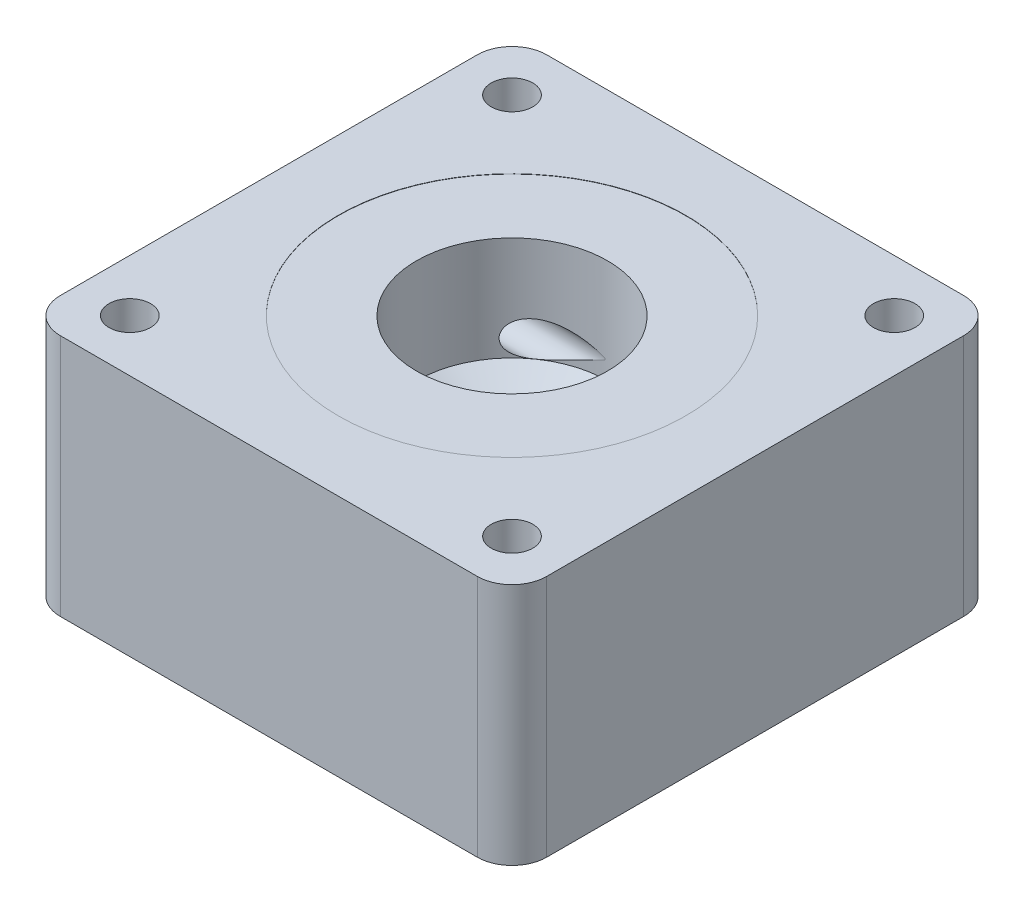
ISO-10303-21;
HEADER;
FILE_DESCRIPTION(('STEP AP214'),'2;1');
FILE_NAME('part.step','',(''),(''),'','','');
FILE_SCHEMA(('AUTOMOTIVE_DESIGN { 1 0 10303 214 1 1 1 1 }'));
ENDSEC;
DATA;
#1=APPLICATION_CONTEXT('core data for automotive mechanical design processes');
#2=APPLICATION_PROTOCOL_DEFINITION('international standard','automotive_design',2000,#1);
#3=PRODUCT_CONTEXT('',#1,'mechanical');
#4=PRODUCT('Part','Part','',(#3));
#5=PRODUCT_RELATED_PRODUCT_CATEGORY('part','',(#4));
#6=PRODUCT_DEFINITION_FORMATION('','',#4);
#7=PRODUCT_DEFINITION_CONTEXT('part definition',#1,'design');
#8=PRODUCT_DEFINITION('design','',#6,#7);
#9=PRODUCT_DEFINITION_SHAPE('','',#8);
#10=(LENGTH_UNIT() NAMED_UNIT(*) SI_UNIT(.MILLI.,.METRE.));
#11=(NAMED_UNIT(*) PLANE_ANGLE_UNIT() SI_UNIT($,.RADIAN.));
#12=(NAMED_UNIT(*) SI_UNIT($,.STERADIAN.) SOLID_ANGLE_UNIT());
#13=UNCERTAINTY_MEASURE_WITH_UNIT(LENGTH_MEASURE(1.E-05),#10,'distance_accuracy_value','');
#14=(GEOMETRIC_REPRESENTATION_CONTEXT(3) GLOBAL_UNCERTAINTY_ASSIGNED_CONTEXT((#13)) GLOBAL_UNIT_ASSIGNED_CONTEXT((#10,
#11,#12)) REPRESENTATION_CONTEXT('',''));
#15=CARTESIAN_POINT('',(0.,0.,0.));
#16=DIRECTION('',(0.,0.,1.));
#17=DIRECTION('',(1.,0.,0.));
#18=AXIS2_PLACEMENT_3D('',#15,#16,#17);
#19=CARTESIAN_POINT('',(0.,22.225,0.));
#20=DIRECTION('',(1.,0.,0.));
#21=DIRECTION('',(0.,0.,-1.));
#22=AXIS2_PLACEMENT_3D('',#19,#20,#21);
#23=PLANE('',#22);
#24=CARTESIAN_POINT('',(0.,14.2875,-29.36748));
#25=DIRECTION('',(-1.,0.,0.));
#26=DIRECTION('',(0.,0.,1.));
#27=AXIS2_PLACEMENT_3D('',#24,#25,#26);
#28=CIRCLE('',#27,2.7051);
#29=CARTESIAN_POINT('',(0.,14.2875,-26.66238));
#30=VERTEX_POINT('',#29);
#31=EDGE_CURVE('E171',#30,#30,#28,.T.);
#32=ORIENTED_EDGE('',*,*,#31,.F.);
#33=EDGE_LOOP('',(#32));
#34=FACE_BOUND('',#33,.T.);
#35=CARTESIAN_POINT('',(0.,14.2875,-15.08252));
#36=DIRECTION('',(-1.,0.,0.));
#37=DIRECTION('',(0.,0.,1.));
#38=AXIS2_PLACEMENT_3D('',#35,#36,#37);
#39=CIRCLE('',#38,2.7051);
#40=CARTESIAN_POINT('',(0.,14.2875,-12.37742));
#41=VERTEX_POINT('',#40);
#42=EDGE_CURVE('E318',#41,#41,#39,.T.);
#43=ORIENTED_EDGE('',*,*,#42,.F.);
#44=EDGE_LOOP('',(#43));
#45=FACE_BOUND('',#44,.T.);
#46=DIRECTION('',(0.,0.,1.));
#47=VECTOR('',#46,1.);
#48=CARTESIAN_POINT('',(0.,0.,0.));
#49=LINE('',#48,#47);
#50=CARTESIAN_POINT('',(0.,0.,-41.275));
#51=VERTEX_POINT('',#50);
#52=CARTESIAN_POINT('',(0.,0.,-3.175));
#53=VERTEX_POINT('',#52);
#54=EDGE_CURVE('E241',#51,#53,#49,.T.);
#55=ORIENTED_EDGE('',*,*,#54,.T.);
#56=DIRECTION('',(0.,-1.,0.));
#57=VECTOR('',#56,1.);
#58=CARTESIAN_POINT('',(0.,22.225,-3.175));
#59=LINE('',#58,#57);
#60=CARTESIAN_POINT('',(0.,22.225,-3.175));
#61=VERTEX_POINT('',#60);
#62=EDGE_CURVE('E209',#53,#61,#59,.F.);
#63=ORIENTED_EDGE('',*,*,#62,.T.);
#64=DIRECTION('',(0.,0.,1.));
#65=VECTOR('',#64,1.);
#66=CARTESIAN_POINT('',(0.,22.225,0.));
#67=LINE('',#66,#65);
#68=CARTESIAN_POINT('',(0.,22.225,-41.275));
#69=VERTEX_POINT('',#68);
#70=EDGE_CURVE('E235',#69,#61,#67,.T.);
#71=ORIENTED_EDGE('',*,*,#70,.F.);
#72=DIRECTION('',(0.,-1.,0.));
#73=VECTOR('',#72,1.);
#74=CARTESIAN_POINT('',(0.,22.225,-41.275));
#75=LINE('',#74,#73);
#76=EDGE_CURVE('E211',#69,#51,#75,.T.);
#77=ORIENTED_EDGE('',*,*,#76,.T.);
#78=EDGE_LOOP('',(#55,#63,#71,#77));
#79=FACE_BOUND('',#78,.T.);
#80=ADVANCED_FACE('F36',(#34,#45,#79),#23,.F.);
#81=CARTESIAN_POINT('',(0.,22.225,0.));
#82=DIRECTION('',(0.,0.,-1.));
#83=DIRECTION('',(-1.,0.,0.));
#84=AXIS2_PLACEMENT_3D('',#81,#82,#83);
#85=PLANE('',#84);
#86=DIRECTION('',(1.,0.,0.));
#87=VECTOR('',#86,1.);
#88=CARTESIAN_POINT('',(0.,22.225,0.));
#89=LINE('',#88,#87);
#90=CARTESIAN_POINT('',(3.175,22.225,0.));
#91=VERTEX_POINT('',#90);
#92=CARTESIAN_POINT('',(41.275,22.225,0.));
#93=VERTEX_POINT('',#92);
#94=EDGE_CURVE('E250',#91,#93,#89,.T.);
#95=ORIENTED_EDGE('',*,*,#94,.F.);
#96=DIRECTION('',(0.,-1.,0.));
#97=VECTOR('',#96,1.);
#98=CARTESIAN_POINT('',(3.175,22.225,0.));
#99=LINE('',#98,#97);
#100=CARTESIAN_POINT('',(3.175,0.,0.));
#101=VERTEX_POINT('',#100);
#102=EDGE_CURVE('E222',#91,#101,#99,.T.);
#103=ORIENTED_EDGE('',*,*,#102,.T.);
#104=DIRECTION('',(1.,0.,0.));
#105=VECTOR('',#104,1.);
#106=CARTESIAN_POINT('',(0.,0.,0.));
#107=LINE('',#106,#105);
#108=CARTESIAN_POINT('',(41.275,0.,0.));
#109=VERTEX_POINT('',#108);
#110=EDGE_CURVE('E238',#101,#109,#107,.T.);
#111=ORIENTED_EDGE('',*,*,#110,.T.);
#112=DIRECTION('',(0.,-1.,0.));
#113=VECTOR('',#112,1.);
#114=CARTESIAN_POINT('',(41.275,22.225,0.));
#115=LINE('',#114,#113);
#116=EDGE_CURVE('E225',#109,#93,#115,.F.);
#117=ORIENTED_EDGE('',*,*,#116,.T.);
#118=EDGE_LOOP('',(#95,#103,#111,#117));
#119=FACE_BOUND('',#118,.T.);
#120=ADVANCED_FACE('F339',(#119),#85,.F.);
#121=CARTESIAN_POINT('',(44.45,22.225,0.));
#122=DIRECTION('',(-1.,0.,0.));
#123=DIRECTION('',(0.,0.,1.));
#124=AXIS2_PLACEMENT_3D('',#121,#122,#123);
#125=PLANE('',#124);
#126=DIRECTION('',(0.,0.,-1.));
#127=VECTOR('',#126,1.);
#128=CARTESIAN_POINT('',(44.45,22.225,0.));
#129=LINE('',#128,#127);
#130=CARTESIAN_POINT('',(44.45,22.225,-3.175));
#131=VERTEX_POINT('',#130);
#132=CARTESIAN_POINT('',(44.45,22.225,-41.275));
#133=VERTEX_POINT('',#132);
#134=EDGE_CURVE('E247',#131,#133,#129,.T.);
#135=ORIENTED_EDGE('',*,*,#134,.F.);
#136=DIRECTION('',(0.,-1.,0.));
#137=VECTOR('',#136,1.);
#138=CARTESIAN_POINT('',(44.45,22.225,-3.175));
#139=LINE('',#138,#137);
#140=CARTESIAN_POINT('',(44.45,0.,-3.175));
#141=VERTEX_POINT('',#140);
#142=EDGE_CURVE('E186',#131,#141,#139,.T.);
#143=ORIENTED_EDGE('',*,*,#142,.T.);
#144=DIRECTION('',(0.,0.,-1.));
#145=VECTOR('',#144,1.);
#146=CARTESIAN_POINT('',(44.45,0.,0.));
#147=LINE('',#146,#145);
#148=CARTESIAN_POINT('',(44.45,0.,-41.275));
#149=VERTEX_POINT('',#148);
#150=EDGE_CURVE('E236',#141,#149,#147,.T.);
#151=ORIENTED_EDGE('',*,*,#150,.T.);
#152=DIRECTION('',(0.,-1.,0.));
#153=VECTOR('',#152,1.);
#154=CARTESIAN_POINT('',(44.45,22.225,-41.275));
#155=LINE('',#154,#153);
#156=EDGE_CURVE('E188',#149,#133,#155,.F.);
#157=ORIENTED_EDGE('',*,*,#156,.T.);
#158=EDGE_LOOP('',(#135,#143,#151,#157));
#159=FACE_BOUND('',#158,.T.);
#160=ADVANCED_FACE('F362',(#159),#125,.F.);
#161=CARTESIAN_POINT('',(0.,22.225,-44.45));
#162=DIRECTION('',(0.,0.,1.));
#163=DIRECTION('',(1.,0.,0.));
#164=AXIS2_PLACEMENT_3D('',#161,#162,#163);
#165=PLANE('',#164);
#166=DIRECTION('',(-1.,0.,0.));
#167=VECTOR('',#166,1.);
#168=CARTESIAN_POINT('',(0.,0.,-44.45));
#169=LINE('',#168,#167);
#170=CARTESIAN_POINT('',(41.275,0.,-44.45));
#171=VERTEX_POINT('',#170);
#172=CARTESIAN_POINT('',(3.175,0.,-44.45));
#173=VERTEX_POINT('',#172);
#174=EDGE_CURVE('E232',#171,#173,#169,.T.);
#175=ORIENTED_EDGE('',*,*,#174,.T.);
#176=DIRECTION('',(0.,-1.,0.));
#177=VECTOR('',#176,1.);
#178=CARTESIAN_POINT('',(3.175,22.225,-44.45));
#179=LINE('',#178,#177);
#180=CARTESIAN_POINT('',(3.175,22.225,-44.45));
#181=VERTEX_POINT('',#180);
#182=EDGE_CURVE('E194',#173,#181,#179,.F.);
#183=ORIENTED_EDGE('',*,*,#182,.T.);
#184=DIRECTION('',(-1.,0.,0.));
#185=VECTOR('',#184,1.);
#186=CARTESIAN_POINT('',(0.,22.225,-44.45));
#187=LINE('',#186,#185);
#188=CARTESIAN_POINT('',(41.275,22.225,-44.45));
#189=VERTEX_POINT('',#188);
#190=EDGE_CURVE('E227',#189,#181,#187,.T.);
#191=ORIENTED_EDGE('',*,*,#190,.F.);
#192=DIRECTION('',(0.,-1.,0.));
#193=VECTOR('',#192,1.);
#194=CARTESIAN_POINT('',(41.275,22.225,-44.45));
#195=LINE('',#194,#193);
#196=EDGE_CURVE('E198',#189,#171,#195,.T.);
#197=ORIENTED_EDGE('',*,*,#196,.T.);
#198=EDGE_LOOP('',(#175,#183,#191,#197));
#199=FACE_BOUND('',#198,.T.);
#200=ADVANCED_FACE('F369',(#199),#165,.F.);
#201=CARTESIAN_POINT('',(0.,22.225,-44.45));
#202=DIRECTION('',(0.,-1.,0.));
#203=DIRECTION('',(0.,0.,-1.));
#204=AXIS2_PLACEMENT_3D('',#201,#202,#203);
#205=PLANE('',#204);
#206=CARTESIAN_POINT('',(22.225,22.225,-22.225));
#207=DIRECTION('',(0.,1.,0.));
#208=DIRECTION('',(0.,0.,1.));
#209=AXIS2_PLACEMENT_3D('',#206,#207,#208);
#210=CIRCLE('',#209,15.875);
#211=CARTESIAN_POINT('',(22.225,22.225,-6.35));
#212=VERTEX_POINT('',#211);
#213=EDGE_CURVE('E292',#212,#212,#210,.T.);
#214=ORIENTED_EDGE('',*,*,#213,.F.);
#215=EDGE_LOOP('',(#214));
#216=FACE_BOUND('',#215,.T.);
#217=CARTESIAN_POINT('',(39.6875,22.225,-39.6875));
#218=DIRECTION('',(0.,-1.,0.));
#219=DIRECTION('',(0.,0.,-1.));
#220=AXIS2_PLACEMENT_3D('',#217,#218,#219);
#221=CIRCLE('',#220,1.89864999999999);
#222=CARTESIAN_POINT('',(39.6875,22.225,-41.58615));
#223=VERTEX_POINT('',#222);
#224=EDGE_CURVE('E281',#223,#223,#221,.T.);
#225=ORIENTED_EDGE('',*,*,#224,.T.);
#226=EDGE_LOOP('',(#225));
#227=FACE_BOUND('',#226,.T.);
#228=CARTESIAN_POINT('',(4.7625,22.225,-39.6875));
#229=DIRECTION('',(0.,-1.,0.));
#230=DIRECTION('',(0.,0.,-1.));
#231=AXIS2_PLACEMENT_3D('',#228,#229,#230);
#232=CIRCLE('',#231,1.89864999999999);
#233=CARTESIAN_POINT('',(4.7625,22.225,-41.58615));
#234=VERTEX_POINT('',#233);
#235=EDGE_CURVE('E272',#234,#234,#232,.T.);
#236=ORIENTED_EDGE('',*,*,#235,.T.);
#237=EDGE_LOOP('',(#236));
#238=FACE_BOUND('',#237,.T.);
#239=CARTESIAN_POINT('',(39.6875,22.225,-4.76250000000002));
#240=DIRECTION('',(0.,-1.,0.));
#241=DIRECTION('',(0.,0.,-1.));
#242=AXIS2_PLACEMENT_3D('',#239,#240,#241);
#243=CIRCLE('',#242,1.89864999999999);
#244=CARTESIAN_POINT('',(39.6875,22.225,-6.66115000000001));
#245=VERTEX_POINT('',#244);
#246=EDGE_CURVE('E263',#245,#245,#243,.T.);
#247=ORIENTED_EDGE('',*,*,#246,.T.);
#248=EDGE_LOOP('',(#247));
#249=FACE_BOUND('',#248,.T.);
#250=CARTESIAN_POINT('',(4.7625,22.225,-4.76250000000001));
#251=DIRECTION('',(0.,-1.,0.));
#252=DIRECTION('',(0.,0.,-1.));
#253=AXIS2_PLACEMENT_3D('',#250,#251,#252);
#254=CIRCLE('',#253,1.89864999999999);
#255=CARTESIAN_POINT('',(4.7625,22.225,-6.66115000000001));
#256=VERTEX_POINT('',#255);
#257=EDGE_CURVE('E244',#256,#256,#254,.T.);
#258=ORIENTED_EDGE('',*,*,#257,.T.);
#259=EDGE_LOOP('',(#258));
#260=FACE_BOUND('',#259,.T.);
#261=ORIENTED_EDGE('',*,*,#70,.T.);
#262=CARTESIAN_POINT('',(3.175,22.225,-3.175));
#263=DIRECTION('',(0.,-1.,0.));
#264=DIRECTION('',(0.,0.,-1.));
#265=AXIS2_PLACEMENT_3D('',#262,#263,#264);
#266=CIRCLE('',#265,3.175);
#267=EDGE_CURVE('E201',#61,#91,#266,.F.);
#268=ORIENTED_EDGE('',*,*,#267,.T.);
#269=ORIENTED_EDGE('',*,*,#94,.T.);
#270=CARTESIAN_POINT('',(41.275,22.225,-3.175));
#271=DIRECTION('',(0.,-1.,0.));
#272=DIRECTION('',(0.,0.,-1.));
#273=AXIS2_PLACEMENT_3D('',#270,#271,#272);
#274=CIRCLE('',#273,3.175);
#275=EDGE_CURVE('E205',#93,#131,#274,.F.);
#276=ORIENTED_EDGE('',*,*,#275,.T.);
#277=ORIENTED_EDGE('',*,*,#134,.T.);
#278=CARTESIAN_POINT('',(41.275,22.225,-41.275));
#279=DIRECTION('',(0.,-1.,0.));
#280=DIRECTION('',(0.,0.,-1.));
#281=AXIS2_PLACEMENT_3D('',#278,#279,#280);
#282=CIRCLE('',#281,3.175);
#283=EDGE_CURVE('E207',#133,#189,#282,.F.);
#284=ORIENTED_EDGE('',*,*,#283,.T.);
#285=ORIENTED_EDGE('',*,*,#190,.T.);
#286=CARTESIAN_POINT('',(3.175,22.225,-41.275));
#287=DIRECTION('',(0.,-1.,0.));
#288=DIRECTION('',(0.,0.,-1.));
#289=AXIS2_PLACEMENT_3D('',#286,#287,#288);
#290=CIRCLE('',#289,3.175);
#291=EDGE_CURVE('E203',#181,#69,#290,.F.);
#292=ORIENTED_EDGE('',*,*,#291,.T.);
#293=EDGE_LOOP('',(#261,#268,#269,#276,#277,#284,#285,#292));
#294=FACE_BOUND('',#293,.T.);
#295=ADVANCED_FACE('F354',(#216,#227,#238,#249,#260,#294),#205,.F.);
#296=CARTESIAN_POINT('',(0.,0.,-44.45));
#297=DIRECTION('',(0.,-1.,0.));
#298=DIRECTION('',(0.,0.,-1.));
#299=AXIS2_PLACEMENT_3D('',#296,#297,#298);
#300=PLANE('',#299);
#301=CARTESIAN_POINT('',(22.2260054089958,0.,-22.225));
#302=DIRECTION('',(0.,-1.,0.));
#303=DIRECTION('',(0.,0.,-1.));
#304=AXIS2_PLACEMENT_3D('',#301,#302,#303);
#305=CIRCLE('',#304,10.5);
#306=CARTESIAN_POINT('',(22.2260054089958,0.,-32.725));
#307=VERTEX_POINT('',#306);
#308=EDGE_CURVE('E297',#307,#307,#305,.T.);
#309=ORIENTED_EDGE('',*,*,#308,.F.);
#310=EDGE_LOOP('',(#309));
#311=FACE_BOUND('',#310,.T.);
#312=CARTESIAN_POINT('',(39.6875,0.,-39.6875));
#313=DIRECTION('',(0.,-1.,0.));
#314=DIRECTION('',(0.,0.,-1.));
#315=AXIS2_PLACEMENT_3D('',#312,#313,#314);
#316=CIRCLE('',#315,3.8989);
#317=CARTESIAN_POINT('',(39.6875,0.,-43.5864));
#318=VERTEX_POINT('',#317);
#319=EDGE_CURVE('E287',#318,#318,#316,.T.);
#320=ORIENTED_EDGE('',*,*,#319,.F.);
#321=EDGE_LOOP('',(#320));
#322=FACE_BOUND('',#321,.T.);
#323=CARTESIAN_POINT('',(4.7625,0.,-39.6875));
#324=DIRECTION('',(0.,-1.,0.));
#325=DIRECTION('',(0.,0.,-1.));
#326=AXIS2_PLACEMENT_3D('',#323,#324,#325);
#327=CIRCLE('',#326,3.8989);
#328=CARTESIAN_POINT('',(4.7625,0.,-43.5864));
#329=VERTEX_POINT('',#328);
#330=EDGE_CURVE('E278',#329,#329,#327,.T.);
#331=ORIENTED_EDGE('',*,*,#330,.F.);
#332=EDGE_LOOP('',(#331));
#333=FACE_BOUND('',#332,.T.);
#334=CARTESIAN_POINT('',(39.6875,0.,-4.76250000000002));
#335=DIRECTION('',(0.,-1.,0.));
#336=DIRECTION('',(0.,0.,-1.));
#337=AXIS2_PLACEMENT_3D('',#334,#335,#336);
#338=CIRCLE('',#337,3.8989);
#339=CARTESIAN_POINT('',(39.6875,0.,-8.66140000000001));
#340=VERTEX_POINT('',#339);
#341=EDGE_CURVE('E269',#340,#340,#338,.T.);
#342=ORIENTED_EDGE('',*,*,#341,.F.);
#343=EDGE_LOOP('',(#342));
#344=FACE_BOUND('',#343,.T.);
#345=CARTESIAN_POINT('',(4.7625,0.,-4.76250000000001));
#346=DIRECTION('',(0.,-1.,0.));
#347=DIRECTION('',(0.,0.,-1.));
#348=AXIS2_PLACEMENT_3D('',#345,#346,#347);
#349=CIRCLE('',#348,3.8989);
#350=CARTESIAN_POINT('',(4.7625,0.,-8.66140000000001));
#351=VERTEX_POINT('',#350);
#352=EDGE_CURVE('E260',#351,#351,#349,.T.);
#353=ORIENTED_EDGE('',*,*,#352,.F.);
#354=EDGE_LOOP('',(#353));
#355=FACE_BOUND('',#354,.T.);
#356=ORIENTED_EDGE('',*,*,#110,.F.);
#357=CARTESIAN_POINT('',(3.175,0.,-3.175));
#358=DIRECTION('',(0.,-1.,0.));
#359=DIRECTION('',(0.,0.,-1.));
#360=AXIS2_PLACEMENT_3D('',#357,#358,#359);
#361=CIRCLE('',#360,3.175);
#362=EDGE_CURVE('E214',#101,#53,#361,.T.);
#363=ORIENTED_EDGE('',*,*,#362,.T.);
#364=ORIENTED_EDGE('',*,*,#54,.F.);
#365=CARTESIAN_POINT('',(3.175,0.,-41.275));
#366=DIRECTION('',(0.,-1.,0.));
#367=DIRECTION('',(0.,0.,-1.));
#368=AXIS2_PLACEMENT_3D('',#365,#366,#367);
#369=CIRCLE('',#368,3.175);
#370=EDGE_CURVE('E216',#51,#173,#369,.T.);
#371=ORIENTED_EDGE('',*,*,#370,.T.);
#372=ORIENTED_EDGE('',*,*,#174,.F.);
#373=CARTESIAN_POINT('',(41.275,0.,-41.275));
#374=DIRECTION('',(0.,-1.,0.));
#375=DIRECTION('',(0.,0.,-1.));
#376=AXIS2_PLACEMENT_3D('',#373,#374,#375);
#377=CIRCLE('',#376,3.175);
#378=EDGE_CURVE('E220',#171,#149,#377,.T.);
#379=ORIENTED_EDGE('',*,*,#378,.T.);
#380=ORIENTED_EDGE('',*,*,#150,.F.);
#381=CARTESIAN_POINT('',(41.275,0.,-3.175));
#382=DIRECTION('',(0.,-1.,0.));
#383=DIRECTION('',(0.,0.,-1.));
#384=AXIS2_PLACEMENT_3D('',#381,#382,#383);
#385=CIRCLE('',#384,3.175);
#386=EDGE_CURVE('E218',#141,#109,#385,.T.);
#387=ORIENTED_EDGE('',*,*,#386,.T.);
#388=EDGE_LOOP('',(#356,#363,#364,#371,#372,#379,#380,#387));
#389=FACE_BOUND('',#388,.T.);
#390=ADVANCED_FACE('F374',(#311,#322,#333,#344,#355,#389),#300,.T.);
#391=CARTESIAN_POINT('',(4.7625,0.,-4.76250000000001));
#392=DIRECTION('',(0.,-1.,0.));
#393=DIRECTION('',(0.,0.,-1.));
#394=AXIS2_PLACEMENT_3D('',#391,#392,#393);
#395=CYLINDRICAL_SURFACE('',#394,1.89865);
#396=ORIENTED_EDGE('',*,*,#257,.F.);
#397=EDGE_LOOP('',(#396));
#398=FACE_BOUND('',#397,.T.);
#399=CARTESIAN_POINT('',(4.7625,2.30102440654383,-4.76250000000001));
#400=DIRECTION('',(0.,-1.,0.));
#401=DIRECTION('',(0.,0.,-1.));
#402=AXIS2_PLACEMENT_3D('',#399,#400,#401);
#403=CIRCLE('',#402,1.89865);
#404=CARTESIAN_POINT('',(4.7625,2.30102440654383,-6.66115000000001));
#405=VERTEX_POINT('',#404);
#406=EDGE_CURVE('E257',#405,#405,#403,.T.);
#407=ORIENTED_EDGE('',*,*,#406,.T.);
#408=EDGE_LOOP('',(#407));
#409=FACE_BOUND('',#408,.T.);
#410=ADVANCED_FACE('F376',(#398,#409),#395,.F.);
#411=CARTESIAN_POINT('',(4.7625,0.,-4.76250000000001));
#412=DIRECTION('',(0.,-1.,0.));
#413=DIRECTION('',(0.,0.,-1.));
#414=AXIS2_PLACEMENT_3D('',#411,#412,#413);
#415=CONICAL_SURFACE('',#414,3.8989,0.715584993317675);
#416=ORIENTED_EDGE('',*,*,#406,.F.);
#417=EDGE_LOOP('',(#416));
#418=FACE_BOUND('',#417,.T.);
#419=ORIENTED_EDGE('',*,*,#352,.T.);
#420=EDGE_LOOP('',(#419));
#421=FACE_BOUND('',#420,.T.);
#422=ADVANCED_FACE('F383',(#418,#421),#415,.F.);
#423=CARTESIAN_POINT('',(39.6875,0.,-4.76250000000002));
#424=DIRECTION('',(0.,-1.,0.));
#425=DIRECTION('',(0.,0.,-1.));
#426=AXIS2_PLACEMENT_3D('',#423,#424,#425);
#427=CYLINDRICAL_SURFACE('',#426,1.89864999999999);
#428=ORIENTED_EDGE('',*,*,#246,.F.);
#429=EDGE_LOOP('',(#428));
#430=FACE_BOUND('',#429,.T.);
#431=CARTESIAN_POINT('',(39.6875,2.30102440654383,-4.76250000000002));
#432=DIRECTION('',(0.,-1.,0.));
#433=DIRECTION('',(0.,0.,-1.));
#434=AXIS2_PLACEMENT_3D('',#431,#432,#433);
#435=CIRCLE('',#434,1.89864999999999);
#436=CARTESIAN_POINT('',(39.6875,2.30102440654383,-6.66115000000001));
#437=VERTEX_POINT('',#436);
#438=EDGE_CURVE('E266',#437,#437,#435,.T.);
#439=ORIENTED_EDGE('',*,*,#438,.T.);
#440=EDGE_LOOP('',(#439));
#441=FACE_BOUND('',#440,.T.);
#442=ADVANCED_FACE('F465',(#430,#441),#427,.F.);
#443=CARTESIAN_POINT('',(39.6875,0.,-4.76250000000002));
#444=DIRECTION('',(0.,-1.,0.));
#445=DIRECTION('',(0.,0.,-1.));
#446=AXIS2_PLACEMENT_3D('',#443,#444,#445);
#447=CONICAL_SURFACE('',#446,3.8989,0.715584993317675);
#448=ORIENTED_EDGE('',*,*,#438,.F.);
#449=EDGE_LOOP('',(#448));
#450=FACE_BOUND('',#449,.T.);
#451=ORIENTED_EDGE('',*,*,#341,.T.);
#452=EDGE_LOOP('',(#451));
#453=FACE_BOUND('',#452,.T.);
#454=ADVANCED_FACE('F472',(#450,#453),#447,.F.);
#455=CARTESIAN_POINT('',(4.7625,0.,-39.6875));
#456=DIRECTION('',(0.,-1.,0.));
#457=DIRECTION('',(0.,0.,-1.));
#458=AXIS2_PLACEMENT_3D('',#455,#456,#457);
#459=CYLINDRICAL_SURFACE('',#458,1.89865);
#460=ORIENTED_EDGE('',*,*,#235,.F.);
#461=EDGE_LOOP('',(#460));
#462=FACE_BOUND('',#461,.T.);
#463=CARTESIAN_POINT('',(4.7625,2.30102440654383,-39.6875));
#464=DIRECTION('',(0.,-1.,0.));
#465=DIRECTION('',(0.,0.,-1.));
#466=AXIS2_PLACEMENT_3D('',#463,#464,#465);
#467=CIRCLE('',#466,1.89865);
#468=CARTESIAN_POINT('',(4.7625,2.30102440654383,-41.58615));
#469=VERTEX_POINT('',#468);
#470=EDGE_CURVE('E275',#469,#469,#467,.T.);
#471=ORIENTED_EDGE('',*,*,#470,.T.);
#472=EDGE_LOOP('',(#471));
#473=FACE_BOUND('',#472,.T.);
#474=ADVANCED_FACE('F478',(#462,#473),#459,.F.);
#475=CARTESIAN_POINT('',(4.7625,0.,-39.6875));
#476=DIRECTION('',(0.,-1.,0.));
#477=DIRECTION('',(0.,0.,-1.));
#478=AXIS2_PLACEMENT_3D('',#475,#476,#477);
#479=CONICAL_SURFACE('',#478,3.8989,0.715584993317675);
#480=ORIENTED_EDGE('',*,*,#470,.F.);
#481=EDGE_LOOP('',(#480));
#482=FACE_BOUND('',#481,.T.);
#483=ORIENTED_EDGE('',*,*,#330,.T.);
#484=EDGE_LOOP('',(#483));
#485=FACE_BOUND('',#484,.T.);
#486=ADVANCED_FACE('F482',(#482,#485),#479,.F.);
#487=CARTESIAN_POINT('',(39.6875,0.,-39.6875));
#488=DIRECTION('',(0.,-1.,0.));
#489=DIRECTION('',(0.,0.,-1.));
#490=AXIS2_PLACEMENT_3D('',#487,#488,#489);
#491=CYLINDRICAL_SURFACE('',#490,1.89864999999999);
#492=ORIENTED_EDGE('',*,*,#224,.F.);
#493=EDGE_LOOP('',(#492));
#494=FACE_BOUND('',#493,.T.);
#495=CARTESIAN_POINT('',(39.6875,2.30102440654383,-39.6875));
#496=DIRECTION('',(0.,-1.,0.));
#497=DIRECTION('',(0.,0.,-1.));
#498=AXIS2_PLACEMENT_3D('',#495,#496,#497);
#499=CIRCLE('',#498,1.89864999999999);
#500=CARTESIAN_POINT('',(39.6875,2.30102440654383,-41.58615));
#501=VERTEX_POINT('',#500);
#502=EDGE_CURVE('E284',#501,#501,#499,.T.);
#503=ORIENTED_EDGE('',*,*,#502,.T.);
#504=EDGE_LOOP('',(#503));
#505=FACE_BOUND('',#504,.T.);
#506=ADVANCED_FACE('F486',(#494,#505),#491,.F.);
#507=CARTESIAN_POINT('',(39.6875,0.,-39.6875));
#508=DIRECTION('',(0.,-1.,0.));
#509=DIRECTION('',(0.,0.,-1.));
#510=AXIS2_PLACEMENT_3D('',#507,#508,#509);
#511=CONICAL_SURFACE('',#510,3.8989,0.715584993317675);
#512=ORIENTED_EDGE('',*,*,#502,.F.);
#513=EDGE_LOOP('',(#512));
#514=FACE_BOUND('',#513,.T.);
#515=ORIENTED_EDGE('',*,*,#319,.T.);
#516=EDGE_LOOP('',(#515));
#517=FACE_BOUND('',#516,.T.);
#518=ADVANCED_FACE('F440',(#514,#517),#511,.F.);
#519=CARTESIAN_POINT('',(22.225,22.1996,-22.225));
#520=DIRECTION('',(0.,1.,0.));
#521=DIRECTION('',(0.,0.,1.));
#522=AXIS2_PLACEMENT_3D('',#519,#520,#521);
#523=PLANE('',#522);
#524=CARTESIAN_POINT('',(22.225,22.1996,-22.225));
#525=DIRECTION('',(0.,1.,0.));
#526=DIRECTION('',(0.,0.,1.));
#527=AXIS2_PLACEMENT_3D('',#524,#525,#526);
#528=CIRCLE('',#527,15.875);
#529=CARTESIAN_POINT('',(22.225,22.1996,-6.35));
#530=VERTEX_POINT('',#529);
#531=EDGE_CURVE('E231',#530,#530,#528,.T.);
#532=ORIENTED_EDGE('',*,*,#531,.T.);
#533=EDGE_LOOP('',(#532));
#534=FACE_BOUND('',#533,.T.);
#535=CARTESIAN_POINT('',(22.225,22.1996,-22.225));
#536=DIRECTION('',(0.,1.,0.));
#537=DIRECTION('',(0.,0.,1.));
#538=AXIS2_PLACEMENT_3D('',#535,#536,#537);
#539=CIRCLE('',#538,8.73125);
#540=CARTESIAN_POINT('',(22.225,22.1996,-13.49375));
#541=VERTEX_POINT('',#540);
#542=EDGE_CURVE('E228',#541,#541,#539,.F.);
#543=ORIENTED_EDGE('',*,*,#542,.T.);
#544=EDGE_LOOP('',(#543));
#545=FACE_BOUND('',#544,.T.);
#546=ADVANCED_FACE('F437',(#534,#545),#523,.T.);
#547=CARTESIAN_POINT('',(22.225,22.1996,-22.225));
#548=DIRECTION('',(0.,1.,0.));
#549=DIRECTION('',(0.,0.,1.));
#550=AXIS2_PLACEMENT_3D('',#547,#548,#549);
#551=CYLINDRICAL_SURFACE('',#550,15.875);
#552=ORIENTED_EDGE('',*,*,#531,.F.);
#553=EDGE_LOOP('',(#552));
#554=FACE_BOUND('',#553,.T.);
#555=ORIENTED_EDGE('',*,*,#213,.T.);
#556=EDGE_LOOP('',(#555));
#557=FACE_BOUND('',#556,.T.);
#558=ADVANCED_FACE('F439',(#554,#557),#551,.F.);
#559=CARTESIAN_POINT('',(22.225,12.7,-22.225));
#560=DIRECTION('',(0.,1.,0.));
#561=DIRECTION('',(0.,0.,1.));
#562=AXIS2_PLACEMENT_3D('',#559,#560,#561);
#563=CONICAL_SURFACE('',#562,8.73125,1.02974425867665);
#564=CARTESIAN_POINT('',(18.2970588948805,10.7918403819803,-26.1537775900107));
#565=CARTESIAN_POINT('',(18.4074384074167,10.7918523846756,-26.2641634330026));
#566=CARTESIAN_POINT('',(18.5224603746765,10.7918648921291,-26.3698810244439));
#567=CARTESIAN_POINT('',(18.7610335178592,10.7918908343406,-26.5712921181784));
#568=CARTESIAN_POINT('',(18.88458692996,10.7919042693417,-26.6669829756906));
#569=CARTESIAN_POINT('',(19.1394242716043,10.7919319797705,-26.8476999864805));
#570=CARTESIAN_POINT('',(19.2707149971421,10.791946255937,-26.932716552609));
#571=CARTESIAN_POINT('',(19.5400441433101,10.7919755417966,-27.0914119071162));
#572=CARTESIAN_POINT('',(19.6780850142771,10.791990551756,-27.1650865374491));
#573=CARTESIAN_POINT('',(19.9597673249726,10.7920211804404,-27.3004780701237));
#574=CARTESIAN_POINT('',(20.1034039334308,10.7920367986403,-27.3622050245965));
#575=CARTESIAN_POINT('',(20.3954203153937,10.7920685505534,-27.4733605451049));
#576=CARTESIAN_POINT('',(20.5438018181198,10.7920846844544,-27.5227845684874));
#577=CARTESIAN_POINT('',(20.8441090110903,10.7921173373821,-27.6089263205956));
#578=CARTESIAN_POINT('',(20.9960324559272,10.7921338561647,-27.645651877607));
#579=CARTESIAN_POINT('',(21.3024891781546,10.7921671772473,-27.7061892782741));
#580=CARTESIAN_POINT('',(21.4570233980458,10.7921839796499,-27.7299963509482));
#581=CARTESIAN_POINT('',(21.7675070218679,10.792217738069,-27.7645021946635));
#582=CARTESIAN_POINT('',(21.9234560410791,10.7922346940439,-27.7752044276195));
#583=CARTESIAN_POINT('',(22.2357590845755,10.7922686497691,-27.7834375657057));
#584=CARTESIAN_POINT('',(22.3921132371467,10.7922856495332,-27.7809636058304));
#585=CARTESIAN_POINT('',(22.7040056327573,10.7923195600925,-27.7628536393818));
#586=CARTESIAN_POINT('',(22.8595441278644,10.7923364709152,-27.7472219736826));
#587=CARTESIAN_POINT('',(23.168808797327,10.7923700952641,-27.7029053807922));
#588=CARTESIAN_POINT('',(23.3225342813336,10.7923868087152,-27.6742156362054));
#589=CARTESIAN_POINT('',(23.6269626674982,10.7924199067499,-27.6039984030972));
#590=CARTESIAN_POINT('',(23.7776667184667,10.7924362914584,-27.562475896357));
#591=CARTESIAN_POINT('',(24.0750947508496,10.7924686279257,-27.4668696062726));
#592=CARTESIAN_POINT('',(24.2218172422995,10.7924845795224,-27.4127811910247));
#593=CARTESIAN_POINT('',(24.5101378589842,10.7925159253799,-27.2924483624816));
#594=CARTESIAN_POINT('',(24.6517378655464,10.7925313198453,-27.226208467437));
#595=CARTESIAN_POINT('',(24.9288756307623,10.792561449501,-27.0820414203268));
#596=CARTESIAN_POINT('',(25.0644111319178,10.7925761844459,-27.0041099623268));
#597=CARTESIAN_POINT('',(25.4603365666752,10.7926192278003,-26.7536095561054));
#598=CARTESIAN_POINT('',(25.710358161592,10.7926464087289,-26.564203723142));
#599=CARTESIAN_POINT('',(26.1749121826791,10.7926969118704,-26.1462023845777));
#600=CARTESIAN_POINT('',(26.3894446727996,10.7927202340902,-25.9176069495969));
#601=CARTESIAN_POINT('',(26.7771248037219,10.7927623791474,-25.4276177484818));
#602=CARTESIAN_POINT('',(26.9502724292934,10.7927812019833,-25.1662239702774));
#603=CARTESIAN_POINT('',(27.2502158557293,10.7928138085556,-24.6180841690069));
#604=CARTESIAN_POINT('',(27.3770116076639,10.7928275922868,-24.3313381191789));
#605=CARTESIAN_POINT('',(27.5806655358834,10.7928497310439,-23.7406269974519));
#606=CARTESIAN_POINT('',(27.6575237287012,10.7928580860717,-23.4366619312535));
#607=CARTESIAN_POINT('',(27.7591170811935,10.7928691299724,-22.8201433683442));
#608=CARTESIAN_POINT('',(27.7838522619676,10.7928718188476,-22.50758987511));
#609=CARTESIAN_POINT('',(27.7804984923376,10.7928714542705,-21.8827662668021));
#610=CARTESIAN_POINT('',(27.7524095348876,10.7928684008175,-21.5704961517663));
#611=CARTESIAN_POINT('',(27.6442045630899,10.7928566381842,-20.9551038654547));
#612=CARTESIAN_POINT('',(27.5640885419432,10.7928479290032,-20.6519816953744));
#613=CARTESIAN_POINT('',(27.3541037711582,10.7928251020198,-20.0634900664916));
#614=CARTESIAN_POINT('',(27.2242350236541,10.7928109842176,-19.7781206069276));
#615=CARTESIAN_POINT('',(26.9184313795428,10.7927777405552,-19.2332352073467));
#616=CARTESIAN_POINT('',(26.7424964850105,10.7927586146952,-18.9737192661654));
#617=CARTESIAN_POINT('',(26.3495548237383,10.7927158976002,-18.4879077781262));
#618=CARTESIAN_POINT('',(26.1325480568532,10.7926923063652,-18.2616122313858));
#619=CARTESIAN_POINT('',(25.6636228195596,10.7926413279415,-17.8486653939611));
#620=CARTESIAN_POINT('',(25.4117043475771,10.7926139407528,-17.6620141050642));
#621=CARTESIAN_POINT('',(24.8801069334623,10.7925561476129,-17.3336542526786));
#622=CARTESIAN_POINT('',(24.6004279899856,10.7925257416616,-17.1919456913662));
#623=CARTESIAN_POINT('',(24.0212488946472,10.79246277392,-16.9574940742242));
#624=CARTESIAN_POINT('',(23.7217487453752,10.79243021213,-16.8647510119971));
#625=CARTESIAN_POINT('',(23.111429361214,10.7923638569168,-16.7308628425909));
#626=CARTESIAN_POINT('',(22.800610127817,10.7923300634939,-16.6897177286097));
#627=CARTESIAN_POINT('',(22.176474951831,10.792262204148,-16.6601942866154));
#628=CARTESIAN_POINT('',(21.8631590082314,10.7922281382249,-16.6718159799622));
#629=CARTESIAN_POINT('',(21.2429271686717,10.7921607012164,-16.7474930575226));
#630=CARTESIAN_POINT('',(20.9360112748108,10.7921273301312,-16.8115484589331));
#631=CARTESIAN_POINT('',(20.3372826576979,10.7920622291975,-16.9902866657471));
#632=CARTESIAN_POINT('',(20.0454699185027,10.7920304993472,-17.1049694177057));
#633=CARTESIAN_POINT('',(19.4852674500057,10.7919695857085,-17.3816614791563));
#634=CARTESIAN_POINT('',(19.2168777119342,10.7919404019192,-17.5436707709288));
#635=CARTESIAN_POINT('',(18.7110036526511,10.7918853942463,-17.9105862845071));
#636=CARTESIAN_POINT('',(18.4735193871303,10.7918595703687,-18.1154925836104));
#637=CARTESIAN_POINT('',(18.145791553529,10.7918239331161,-18.4503087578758));
#638=CARTESIAN_POINT('',(18.0412503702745,10.7918125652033,-18.5665598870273));
#639=CARTESIAN_POINT('',(17.8423373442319,10.7917909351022,-18.8074397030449));
#640=CARTESIAN_POINT('',(17.7479617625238,10.7917806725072,-18.9320652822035));
#641=CARTESIAN_POINT('',(17.5700188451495,10.791761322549,-19.1888630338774));
#642=CARTESIAN_POINT('',(17.4864555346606,10.7917522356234,-19.3210379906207));
#643=CARTESIAN_POINT('',(17.3307891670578,10.7917353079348,-19.5919106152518));
#644=CARTESIAN_POINT('',(17.2586818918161,10.7917274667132,-19.7306058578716));
#645=CARTESIAN_POINT('',(17.1263804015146,10.7917130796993,-20.0136313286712));
#646=CARTESIAN_POINT('',(17.066190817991,10.7917065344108,-20.1579637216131));
#647=CARTESIAN_POINT('',(16.958206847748,10.7916947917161,-20.451132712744));
#648=CARTESIAN_POINT('',(16.9104078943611,10.7916895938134,-20.5999676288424));
#649=CARTESIAN_POINT('',(16.8275023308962,10.7916805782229,-20.901184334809));
#650=CARTESIAN_POINT('',(16.7923999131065,10.7916767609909,-21.0535672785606));
#651=CARTESIAN_POINT('',(16.7351696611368,10.7916705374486,-21.3606921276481));
#652=CARTESIAN_POINT('',(16.7130370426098,10.7916681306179,-21.5154331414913));
#653=CARTESIAN_POINT('',(16.6818794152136,10.7916647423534,-21.8262706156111));
#654=CARTESIAN_POINT('',(16.6728578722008,10.7916637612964,-21.98236742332));
#655=CARTESIAN_POINT('',(16.6679984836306,10.7916632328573,-22.2947083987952));
#656=CARTESIAN_POINT('',(16.6721557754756,10.7916636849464,-22.4509524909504));
#657=CARTESIAN_POINT('',(16.6936205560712,10.7916660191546,-22.7626319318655));
#658=CARTESIAN_POINT('',(16.7109361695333,10.7916679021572,-22.9180667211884));
#659=CARTESIAN_POINT('',(16.7585951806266,10.7916730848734,-23.2268671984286));
#660=CARTESIAN_POINT('',(16.7889337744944,10.7916763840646,-23.3802336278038));
#661=CARTESIAN_POINT('',(16.8624535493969,10.791684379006,-23.6839944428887));
#662=CARTESIAN_POINT('',(16.9056455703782,10.791689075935,-23.834386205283));
#663=CARTESIAN_POINT('',(17.004536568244,10.7916998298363,-24.1309380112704));
#664=CARTESIAN_POINT('',(17.0602309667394,10.7917058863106,-24.2770995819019));
#665=CARTESIAN_POINT('',(17.1836863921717,10.7917193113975,-24.564082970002));
#666=CARTESIAN_POINT('',(17.2514366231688,10.791726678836,-24.7049094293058));
#667=CARTESIAN_POINT('',(17.3985287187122,10.7917426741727,-24.9803136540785));
#668=CARTESIAN_POINT('',(17.4778675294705,10.7917513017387,-25.1148930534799));
#669=CARTESIAN_POINT('',(17.6687376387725,10.7917720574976,-25.4095274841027));
#670=CARTESIAN_POINT('',(17.7833668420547,10.7917845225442,-25.5675879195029));
#671=CARTESIAN_POINT('',(18.0286034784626,10.7918111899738,-25.8707850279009));
#672=CARTESIAN_POINT('',(18.1592109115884,10.7918253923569,-26.0159217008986));
#673=CARTESIAN_POINT('',(18.2970588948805,10.7918403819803,-26.1537775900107));
#674=B_SPLINE_CURVE_WITH_KNOTS('',3,(#564,#565,#566,#567,#568,#569,#570,#571,#572,#573,#574,
#575,#576,#577,#578,#579,#580,#581,#582,#583,#584,#585,#586,#587,#588,#589,#590,#591,#592,#593,
#594,#595,#596,#597,#598,#599,#600,#601,#602,#603,#604,#605,#606,#607,#608,#609,#610,#611,#612,
#613,#614,#615,#616,#617,#618,#619,#620,#621,#622,#623,#624,#625,#626,#627,#628,#629,#630,#631,
#632,#633,#634,#635,#636,#637,#638,#639,#640,#641,#642,#643,#644,#645,#646,#647,#648,#649,#650,
#651,#652,#653,#654,#655,#656,#657,#658,#659,#660,#661,#662,#663,#664,#665,#666,#667,#668,#669,
#670,#671,#672,#673),.UNSPECIFIED.,.T.,.F.,(4,2,2,2,2,2,2,2,2,2,2,2,2,2,2,2,2,2,2,2,2,2,2,2,2,2,
2,2,2,2,2,2,2,2,2,2,2,2,2,2,2,2,2,2,2,2,2,2,2,2,2,2,2,2,4),(0.,0.46814375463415,
0.936410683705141,1.40509522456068,1.87395118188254,2.34241093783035,2.81104340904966,
3.27938646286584,3.74790236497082,4.21629447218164,4.68485953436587,5.15327007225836,
5.62185355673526,6.09025536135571,6.55883009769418,7.02723095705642,7.49580475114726,
8.43194815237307,9.36808986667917,10.3042319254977,11.2403749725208,12.1765177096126,
13.1126600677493,14.0488025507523,14.9849451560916,15.9210877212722,16.8572302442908,
17.7933727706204,18.7295153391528,19.6656579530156,20.601800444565,21.5379428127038,
22.4740855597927,23.410228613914,24.3463706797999,25.2825123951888,26.2186557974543,
26.6872295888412,27.1556304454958,27.6242051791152,28.092606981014,28.5611904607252,
29.0296009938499,29.4981660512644,29.9665581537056,30.4350740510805,30.9034171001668,
31.3720495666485,31.8405093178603,32.3093652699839,32.7780498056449,33.2463167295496,
33.7144604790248,34.2991040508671,34.8837476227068),.UNSPECIFIED.);
#675=CARTESIAN_POINT('',(18.2970588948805,10.7918403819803,-26.1537775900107));
#676=VERTEX_POINT('',#675);
#677=EDGE_CURVE('E178',#676,#676,#674,.T.);
#678=ORIENTED_EDGE('',*,*,#677,.T.);
#679=EDGE_LOOP('',(#678));
#680=FACE_BOUND('',#679,.T.);
#681=CARTESIAN_POINT('',(22.225,12.7,-22.225));
#682=DIRECTION('',(0.,1.,0.));
#683=DIRECTION('',(0.,0.,1.));
#684=AXIS2_PLACEMENT_3D('',#681,#682,#683);
#685=CIRCLE('',#684,8.73125);
#686=CARTESIAN_POINT('',(17.2030774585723,12.7,-29.36748));
#687=VERTEX_POINT('',#686);
#688=CARTESIAN_POINT('',(17.2030774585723,12.7,-15.08252));
#689=VERTEX_POINT('',#688);
#690=EDGE_CURVE('E290',#687,#689,#685,.T.);
#691=ORIENTED_EDGE('',*,*,#690,.T.);
#692=EDGE_CURVE('E129',#689,#687,#685,.T.);
#693=ORIENTED_EDGE('',*,*,#692,.T.);
#694=EDGE_LOOP('',(#691,#693));
#695=FACE_BOUND('',#694,.T.);
#696=ADVANCED_FACE('F443',(#680,#695),#563,.F.);
#697=CARTESIAN_POINT('',(22.225,22.225,-22.225));
#698=DIRECTION('',(0.,1.,0.));
#699=DIRECTION('',(0.,0.,1.));
#700=AXIS2_PLACEMENT_3D('',#697,#698,#699);
#701=CYLINDRICAL_SURFACE('',#700,8.73125);
#702=CARTESIAN_POINT('',(21.98624,14.2875,-15.08252));
#703=DIRECTION('',(1.,0.,0.));
#704=DIRECTION('',(0.,0.0501193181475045,0.998743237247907));
#705=AXIS2_PLACEMENT_3D('',#702,#703,#704);
#706=CIRCLE('',#705,1.5875);
#707=CARTESIAN_POINT('',(21.98624,14.3670644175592,-13.4970151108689));
#708=VERTEX_POINT('',#707);
#709=CARTESIAN_POINT('',(21.98624,14.2079355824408,-13.4970151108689));
#710=VERTEX_POINT('',#709);
#711=EDGE_CURVE('E11',#708,#710,#706,.T.);
#712=ORIENTED_EDGE('',*,*,#711,.F.);
#713=CARTESIAN_POINT('',(21.98624,14.3670644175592,-13.4970151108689));
#714=CARTESIAN_POINT('',(21.9623736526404,14.3798782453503,-13.4976665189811));
#715=CARTESIAN_POINT('',(21.9382094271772,14.3920897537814,-13.4984268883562));
#716=CARTESIAN_POINT('',(21.8895319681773,14.4157649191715,-13.5001634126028));
#717=CARTESIAN_POINT('',(21.8650188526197,14.4272288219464,-13.5011394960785));
#718=CARTESIAN_POINT('',(21.79131609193,14.4611892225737,-13.5043882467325));
#719=CARTESIAN_POINT('',(21.7419490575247,14.4832612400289,-13.5069817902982));
#720=CARTESIAN_POINT('',(21.6430653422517,14.5269195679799,-13.5130236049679));
#721=CARTESIAN_POINT('',(21.5935486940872,14.5485059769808,-13.51647170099));
#722=CARTESIAN_POINT('',(21.4944510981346,14.5913836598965,-13.5242244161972));
#723=CARTESIAN_POINT('',(21.4448701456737,14.6126749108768,-13.5285291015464));
#724=CARTESIAN_POINT('',(21.2960312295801,14.6762329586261,-13.5427374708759));
#725=CARTESIAN_POINT('',(21.1967453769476,14.7181542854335,-13.5539313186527));
#726=CARTESIAN_POINT('',(20.9982569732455,14.8011257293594,-13.579778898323));
#727=CARTESIAN_POINT('',(20.8990544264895,14.84217580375,-13.5944327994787));
#728=CARTESIAN_POINT('',(20.6994394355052,14.9238260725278,-13.6274558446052));
#729=CARTESIAN_POINT('',(20.5990292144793,14.9644122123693,-13.6458735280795));
#730=CARTESIAN_POINT('',(20.3984524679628,15.0443420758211,-13.6863280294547));
#731=CARTESIAN_POINT('',(20.2982859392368,15.08368581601,-13.7083647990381));
#732=CARTESIAN_POINT('',(19.9983025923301,15.1994857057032,-13.7799538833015));
#733=CARTESIAN_POINT('',(19.7989019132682,15.2737518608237,-13.835001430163));
#734=CARTESIAN_POINT('',(19.4403316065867,15.4005115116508,-13.948012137));
#735=CARTESIAN_POINT('',(19.280837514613,15.4544384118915,-14.003353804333));
#736=CARTESIAN_POINT('',(18.9634007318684,15.5554391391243,-14.1240414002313));
#737=CARTESIAN_POINT('',(18.8054582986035,15.6025118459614,-14.18938896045));
#738=CARTESIAN_POINT('',(18.4924833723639,15.6876657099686,-14.3299183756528));
#739=CARTESIAN_POINT('',(18.3374403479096,15.7257902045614,-14.4050499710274));
#740=CARTESIAN_POINT('',(18.0303523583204,15.7909017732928,-14.5653882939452));
#741=CARTESIAN_POINT('',(17.8783053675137,15.8178966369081,-14.6505879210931));
#742=CARTESIAN_POINT('',(17.5688574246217,15.8588892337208,-14.8365268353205));
#743=CARTESIAN_POINT('',(17.411703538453,15.8719840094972,-14.9379000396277));
#744=CARTESIAN_POINT('',(17.1809493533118,15.8758181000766,-15.0975137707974));
#745=CARTESIAN_POINT('',(17.104843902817,15.8744593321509,-15.1519906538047));
#746=CARTESIAN_POINT('',(16.954655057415,15.865672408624,-15.2631814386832));
#747=CARTESIAN_POINT('',(16.8805712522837,15.8582454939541,-15.3198948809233));
#748=CARTESIAN_POINT('',(16.6928062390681,15.8301567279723,-15.4684500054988));
#749=CARTESIAN_POINT('',(16.5809220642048,15.8043329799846,-15.5616922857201));
#750=CARTESIAN_POINT('',(16.3658938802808,15.7313865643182,-15.7499796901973));
#751=CARTESIAN_POINT('',(16.2627341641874,15.6843031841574,-15.8450211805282));
#752=CARTESIAN_POINT('',(16.0985247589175,15.5829860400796,-16.0032774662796));
#753=CARTESIAN_POINT('',(16.0342447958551,15.5353420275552,-16.0673370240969));
#754=CARTESIAN_POINT('',(15.9134054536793,15.4266264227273,-16.1912661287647));
#755=CARTESIAN_POINT('',(15.8568358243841,15.365572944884,-16.2511411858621));
#756=CARTESIAN_POINT('',(15.7631087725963,15.2423032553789,-16.3528141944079));
#757=CARTESIAN_POINT('',(15.7242979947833,15.1824189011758,-16.3959024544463));
#758=CARTESIAN_POINT('',(15.6543995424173,15.0538983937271,-16.4748074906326));
#759=CARTESIAN_POINT('',(15.6233096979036,14.9852647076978,-16.5106263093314));
#760=CARTESIAN_POINT('',(15.5699058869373,14.8399449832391,-16.5729066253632));
#761=CARTESIAN_POINT('',(15.5476609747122,14.7632012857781,-16.5992943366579));
#762=CARTESIAN_POINT('',(15.5133974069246,14.6044375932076,-16.6402128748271));
#763=CARTESIAN_POINT('',(15.5013707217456,14.5224217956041,-16.6547530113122));
#764=CARTESIAN_POINT('',(15.4890413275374,14.3672592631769,-16.6696727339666));
#765=CARTESIAN_POINT('',(15.487402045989,14.2943687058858,-16.6716664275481));
#766=CARTESIAN_POINT('',(15.4923601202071,14.1492992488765,-16.665656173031));
#767=CARTESIAN_POINT('',(15.498954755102,14.0771201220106,-16.6576555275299));
#768=CARTESIAN_POINT('',(15.5195870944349,13.9390884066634,-16.632826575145));
#769=CARTESIAN_POINT('',(15.5332519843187,13.8730984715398,-16.6164408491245));
#770=CARTESIAN_POINT('',(15.567293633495,13.7453339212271,-16.5760739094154));
#771=CARTESIAN_POINT('',(15.5876710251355,13.6835597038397,-16.5520919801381));
#772=CARTESIAN_POINT('',(15.6359755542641,13.5616301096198,-16.4960447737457));
#773=CARTESIAN_POINT('',(15.664298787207,13.5018244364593,-16.463564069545));
#774=CARTESIAN_POINT('',(15.7269282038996,13.389064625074,-16.3930173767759));
#775=CARTESIAN_POINT('',(15.7612377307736,13.3361143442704,-16.3549482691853));
#776=CARTESIAN_POINT('',(15.8514110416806,13.2153840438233,-16.2568983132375));
#777=CARTESIAN_POINT('',(15.9100744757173,13.1514825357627,-16.1947025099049));
#778=CARTESIAN_POINT('',(16.0357742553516,13.0381708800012,-16.0657483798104));
#779=CARTESIAN_POINT('',(16.1028274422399,12.9887905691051,-15.9989810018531));
#780=CARTESIAN_POINT('',(16.2722664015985,12.8856925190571,-15.8360640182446));
#781=CARTESIAN_POINT('',(16.3778484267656,12.8385311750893,-15.7391151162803));
#782=CARTESIAN_POINT('',(16.597894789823,12.7660859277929,-15.5472859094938));
#783=CARTESIAN_POINT('',(16.7123738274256,12.7408391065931,-15.45240937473));
#784=CARTESIAN_POINT('',(16.921567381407,12.7116604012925,-15.2880011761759));
#785=CARTESIAN_POINT('',(17.0150769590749,12.7042570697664,-15.2174922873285));
#786=CARTESIAN_POINT('',(17.2050769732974,12.6985132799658,-15.0801525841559));
#787=CARTESIAN_POINT('',(17.3015690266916,12.7001778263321,-15.0133238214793));
#788=CARTESIAN_POINT('',(17.4969777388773,12.711152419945,-14.8837260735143));
#789=CARTESIAN_POINT('',(17.595897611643,12.7204731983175,-14.8209629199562));
#790=CARTESIAN_POINT('',(17.795585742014,12.7455833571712,-14.6997979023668));
#791=CARTESIAN_POINT('',(17.8963546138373,12.7613749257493,-14.6413975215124));
#792=CARTESIAN_POINT('',(18.1637218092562,12.8101652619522,-14.4934635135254));
#793=CARTESIAN_POINT('',(18.3315624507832,12.8477263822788,-14.4076581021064));
#794=CARTESIAN_POINT('',(18.6700708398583,12.9339890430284,-14.2480157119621));
#795=CARTESIAN_POINT('',(18.8407402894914,12.9826975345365,-14.1741862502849));
#796=CARTESIAN_POINT('',(19.1845155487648,13.0887865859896,-14.0381547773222));
#797=CARTESIAN_POINT('',(19.3576264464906,13.1461888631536,-13.975982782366));
#798=CARTESIAN_POINT('',(19.7052575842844,13.2675143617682,-13.8632409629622));
#799=CARTESIAN_POINT('',(19.8797775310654,13.3314362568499,-13.8126687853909));
#800=CARTESIAN_POINT('',(20.2158730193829,13.4588868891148,-13.7264247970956));
#801=CARTESIAN_POINT('',(20.3773697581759,13.5220396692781,-13.6898857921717));
#802=CARTESIAN_POINT('',(20.6200365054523,13.6191141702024,-13.6421324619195));
#803=CARTESIAN_POINT('',(20.7009988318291,13.6518645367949,-13.6273901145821));
#804=CARTESIAN_POINT('',(20.8630396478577,13.7180505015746,-13.6002368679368));
#805=CARTESIAN_POINT('',(20.9441181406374,13.751486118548,-13.5878260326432));
#806=CARTESIAN_POINT('',(21.1056370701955,13.8186674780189,-13.5654190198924));
#807=CARTESIAN_POINT('',(21.1860769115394,13.8524079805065,-13.555402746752));
#808=CARTESIAN_POINT('',(21.3469621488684,13.9204560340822,-13.5376341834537));
#809=CARTESIAN_POINT('',(21.4274075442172,13.9547635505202,-13.5298817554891));
#810=CARTESIAN_POINT('',(21.5479878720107,14.0067446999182,-13.5199436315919));
#811=CARTESIAN_POINT('',(21.5881664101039,14.0241582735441,-13.5169126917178));
#812=CARTESIAN_POINT('',(21.6684367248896,14.0592596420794,-13.5114137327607));
#813=CARTESIAN_POINT('',(21.7085285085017,14.076947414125,-13.5089456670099));
#814=CARTESIAN_POINT('',(21.7886102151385,14.1126647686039,-13.5045706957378));
#815=CARTESIAN_POINT('',(21.8286001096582,14.1306944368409,-13.5026639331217));
#816=CARTESIAN_POINT('',(21.9079895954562,14.1680777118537,-13.4994149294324));
#817=CARTESIAN_POINT('',(21.9473889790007,14.1874317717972,-13.4980728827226));
#818=CARTESIAN_POINT('',(21.9862400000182,14.2079355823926,-13.4970151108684));
#819=B_SPLINE_CURVE_WITH_KNOTS('',3,(#713,#714,#715,#716,#717,#718,#719,#720,#721,#722,#723,
#724,#725,#726,#727,#728,#729,#730,#731,#732,#733,#734,#735,#736,#737,#738,#739,#740,#741,#742,
#743,#744,#745,#746,#747,#748,#749,#750,#751,#752,#753,#754,#755,#756,#757,#758,#759,#760,#761,
#762,#763,#764,#765,#766,#767,#768,#769,#770,#771,#772,#773,#774,#775,#776,#777,#778,#779,#780,
#781,#782,#783,#784,#785,#786,#787,#788,#789,#790,#791,#792,#793,#794,#795,#796,#797,#798,#799,
#800,#801,#802,#803,#804,#805,#806,#807,#808,#809,#810,#811,#812,#813,#814,#815,#816,#817,#818),
.UNSPECIFIED.,.F.,.F.,(4,2,2,2,2,2,2,2,2,2,2,2,2,2,2,2,2,2,2,2,2,2,2,2,2,2,2,2,2,2,2,2,2,2,2,2,
2,2,2,2,2,2,2,2,2,2,2,2,2,2,2,2,4),(0.,0.0812534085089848,0.162479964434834,0.324886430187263,
0.487259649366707,0.649645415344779,0.974640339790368,1.29965116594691,1.62915301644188,
1.95865046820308,2.6173174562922,3.14863528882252,3.6800398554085,4.20881505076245,
4.7372195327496,5.29817051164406,5.57877433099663,5.85932078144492,6.30162072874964,
6.74310663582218,7.04958337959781,7.3556486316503,7.60474239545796,7.85376607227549,
8.10469745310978,8.35543146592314,8.57311079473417,8.79071821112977,8.99787095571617,
9.20504322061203,9.42532309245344,9.64572637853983,9.96415632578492,10.2832360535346,
10.7334373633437,11.1843989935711,11.5359674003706,11.8877298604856,12.2399862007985,
12.5923617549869,13.168080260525,13.7441587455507,14.3217007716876,14.8991255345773,
15.4304556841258,15.6961412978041,15.9618342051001,16.2252122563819,16.4885742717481,
16.6202534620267,16.7519217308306,16.8836234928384,17.0153705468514),.UNSPECIFIED.);
#820=EDGE_CURVE('E53',#708,#689,#819,.T.);
#821=ORIENTED_EDGE('',*,*,#820,.T.);
#822=ORIENTED_EDGE('',*,*,#690,.F.);
#823=CARTESIAN_POINT('',(21.98624,14.2079355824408,-30.952984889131));
#824=CARTESIAN_POINT('',(21.9623736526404,14.1951217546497,-30.9523334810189));
#825=CARTESIAN_POINT('',(21.9382094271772,14.1829102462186,-30.9515731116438));
#826=CARTESIAN_POINT('',(21.8895319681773,14.1592350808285,-30.9498365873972));
#827=CARTESIAN_POINT('',(21.8650188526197,14.1477711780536,-30.9488605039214));
#828=CARTESIAN_POINT('',(21.79131609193,14.1138107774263,-30.9456117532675));
#829=CARTESIAN_POINT('',(21.7419490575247,14.0917387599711,-30.9430182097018));
#830=CARTESIAN_POINT('',(21.6430653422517,14.0480804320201,-30.9369763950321));
#831=CARTESIAN_POINT('',(21.5935486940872,14.0264940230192,-30.93352829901));
#832=CARTESIAN_POINT('',(21.4944510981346,13.9836163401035,-30.9257755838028));
#833=CARTESIAN_POINT('',(21.4448701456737,13.9623250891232,-30.9214708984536));
#834=CARTESIAN_POINT('',(21.2960312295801,13.8987670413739,-30.9072625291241));
#835=CARTESIAN_POINT('',(21.1967453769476,13.8568457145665,-30.8960686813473));
#836=CARTESIAN_POINT('',(20.9982569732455,13.7738742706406,-30.870221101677));
#837=CARTESIAN_POINT('',(20.8990544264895,13.73282419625,-30.8555672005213));
#838=CARTESIAN_POINT('',(20.6994394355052,13.6511739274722,-30.8225441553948));
#839=CARTESIAN_POINT('',(20.5990292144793,13.6105877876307,-30.8041264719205));
#840=CARTESIAN_POINT('',(20.3984524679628,13.5306579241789,-30.7636719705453));
#841=CARTESIAN_POINT('',(20.2982859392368,13.49131418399,-30.7416352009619));
#842=CARTESIAN_POINT('',(19.9983025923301,13.3755142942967,-30.6700461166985));
#843=CARTESIAN_POINT('',(19.7989019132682,13.3012481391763,-30.614998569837));
#844=CARTESIAN_POINT('',(19.4403316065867,13.1744884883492,-30.501987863));
#845=CARTESIAN_POINT('',(19.280837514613,13.1205615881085,-30.446646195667));
#846=CARTESIAN_POINT('',(18.9634007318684,13.0195608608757,-30.3259585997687));
#847=CARTESIAN_POINT('',(18.8054582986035,12.9724881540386,-30.26061103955));
#848=CARTESIAN_POINT('',(18.4924833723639,12.8873342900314,-30.1200816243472));
#849=CARTESIAN_POINT('',(18.3374403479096,12.8492097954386,-30.0449500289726));
#850=CARTESIAN_POINT('',(18.0303523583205,12.7840982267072,-29.8846117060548));
#851=CARTESIAN_POINT('',(17.8783053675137,12.7571033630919,-29.7994120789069));
#852=CARTESIAN_POINT('',(17.5688574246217,12.7161107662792,-29.6134731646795));
#853=CARTESIAN_POINT('',(17.411703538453,12.7030159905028,-29.5120999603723));
#854=CARTESIAN_POINT('',(17.1809493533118,12.6991818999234,-29.3524862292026));
#855=CARTESIAN_POINT('',(17.104843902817,12.7005406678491,-29.2980093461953));
#856=CARTESIAN_POINT('',(16.954655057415,12.709327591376,-29.1868185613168));
#857=CARTESIAN_POINT('',(16.8805712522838,12.7167545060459,-29.1301051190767));
#858=CARTESIAN_POINT('',(16.6928062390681,12.7448432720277,-28.9815499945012));
#859=CARTESIAN_POINT('',(16.5809220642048,12.7706670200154,-28.8883077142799));
#860=CARTESIAN_POINT('',(16.3658938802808,12.8436134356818,-28.7000203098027));
#861=CARTESIAN_POINT('',(16.2627341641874,12.8906968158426,-28.6049788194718));
#862=CARTESIAN_POINT('',(16.0985247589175,12.9920139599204,-28.4467225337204));
#863=CARTESIAN_POINT('',(16.0342447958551,13.0396579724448,-28.3826629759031));
#864=CARTESIAN_POINT('',(15.9134054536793,13.1483735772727,-28.2587338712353));
#865=CARTESIAN_POINT('',(15.8568358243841,13.209427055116,-28.1988588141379));
#866=CARTESIAN_POINT('',(15.7631087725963,13.3326967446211,-28.0971858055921));
#867=CARTESIAN_POINT('',(15.7242979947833,13.3925810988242,-28.0540975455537));
#868=CARTESIAN_POINT('',(15.6543995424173,13.5211016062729,-27.9751925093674));
#869=CARTESIAN_POINT('',(15.6233096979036,13.5897352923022,-27.9393736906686));
#870=CARTESIAN_POINT('',(15.5699058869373,13.7350550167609,-27.8770933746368));
#871=CARTESIAN_POINT('',(15.5476609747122,13.8117987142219,-27.8507056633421));
#872=CARTESIAN_POINT('',(15.5133974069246,13.9705624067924,-27.8097871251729));
#873=CARTESIAN_POINT('',(15.5013707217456,14.0525782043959,-27.7952469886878));
#874=CARTESIAN_POINT('',(15.4890413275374,14.2077407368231,-27.7803272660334));
#875=CARTESIAN_POINT('',(15.487402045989,14.2806312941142,-27.7783335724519));
#876=CARTESIAN_POINT('',(15.4923601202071,14.4257007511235,-27.784343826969));
#877=CARTESIAN_POINT('',(15.498954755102,14.4978798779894,-27.7923444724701));
#878=CARTESIAN_POINT('',(15.5195870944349,14.6359115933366,-27.8171734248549));
#879=CARTESIAN_POINT('',(15.5332519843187,14.7019015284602,-27.8335591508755));
#880=CARTESIAN_POINT('',(15.567293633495,14.8296660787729,-27.8739260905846));
#881=CARTESIAN_POINT('',(15.5876710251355,14.8914402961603,-27.8979080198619));
#882=CARTESIAN_POINT('',(15.6359755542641,15.0133698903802,-27.9539552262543));
#883=CARTESIAN_POINT('',(15.664298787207,15.0731755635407,-27.986435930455));
#884=CARTESIAN_POINT('',(15.7269282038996,15.185935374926,-28.0569826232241));
#885=CARTESIAN_POINT('',(15.7612377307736,15.2388856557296,-28.0950517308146));
#886=CARTESIAN_POINT('',(15.8514110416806,15.3596159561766,-28.1931016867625));
#887=CARTESIAN_POINT('',(15.9100744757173,15.4235174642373,-28.2552974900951));
#888=CARTESIAN_POINT('',(16.0357742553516,15.5368291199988,-28.3842516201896));
#889=CARTESIAN_POINT('',(16.1028274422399,15.5862094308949,-28.4510189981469));
#890=CARTESIAN_POINT('',(16.2722664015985,15.6893074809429,-28.6139359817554));
#891=CARTESIAN_POINT('',(16.3778484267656,15.7364688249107,-28.7108848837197));
#892=CARTESIAN_POINT('',(16.597894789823,15.8089140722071,-28.9027140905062));
#893=CARTESIAN_POINT('',(16.7123738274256,15.8341608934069,-28.99759062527));
#894=CARTESIAN_POINT('',(16.921567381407,15.8633395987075,-29.1619988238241));
#895=CARTESIAN_POINT('',(17.0150769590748,15.8707429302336,-29.2325077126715));
#896=CARTESIAN_POINT('',(17.2050769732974,15.8764867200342,-29.3698474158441));
#897=CARTESIAN_POINT('',(17.3015690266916,15.8748221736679,-29.4366761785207));
#898=CARTESIAN_POINT('',(17.4969777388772,15.863847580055,-29.5662739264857));
#899=CARTESIAN_POINT('',(17.5958976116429,15.8545268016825,-29.6290370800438));
#900=CARTESIAN_POINT('',(17.795585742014,15.8294166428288,-29.7502020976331));
#901=CARTESIAN_POINT('',(17.8963546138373,15.8136250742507,-29.8086024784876));
#902=CARTESIAN_POINT('',(18.1637218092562,15.7648347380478,-29.9565364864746));
#903=CARTESIAN_POINT('',(18.3315624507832,15.7272736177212,-30.0423418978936));
#904=CARTESIAN_POINT('',(18.6700708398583,15.6410109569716,-30.2019842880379));
#905=CARTESIAN_POINT('',(18.8407402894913,15.5923024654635,-30.275813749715));
#906=CARTESIAN_POINT('',(19.1845155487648,15.4862134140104,-30.4118452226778));
#907=CARTESIAN_POINT('',(19.3576264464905,15.4288111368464,-30.474017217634));
#908=CARTESIAN_POINT('',(19.7052575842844,15.3074856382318,-30.5867590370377));
#909=CARTESIAN_POINT('',(19.8797775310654,15.2435637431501,-30.6373312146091));
#910=CARTESIAN_POINT('',(20.2158730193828,15.1161131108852,-30.7235752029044));
#911=CARTESIAN_POINT('',(20.3773697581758,15.0529603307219,-30.7601142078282));
#912=CARTESIAN_POINT('',(20.6200365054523,14.9558858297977,-30.8078675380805));
#913=CARTESIAN_POINT('',(20.7009988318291,14.9231354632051,-30.8226098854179));
#914=CARTESIAN_POINT('',(20.8630396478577,14.8569494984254,-30.8497631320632));
#915=CARTESIAN_POINT('',(20.9441181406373,14.823513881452,-30.8621739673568));
#916=CARTESIAN_POINT('',(21.1056370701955,14.7563325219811,-30.8845809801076));
#917=CARTESIAN_POINT('',(21.1860769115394,14.7225920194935,-30.894597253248));
#918=CARTESIAN_POINT('',(21.3469621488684,14.6545439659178,-30.9123658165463));
#919=CARTESIAN_POINT('',(21.4274075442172,14.6202364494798,-30.9201182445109));
#920=CARTESIAN_POINT('',(21.5479878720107,14.5682553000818,-30.9300563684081));
#921=CARTESIAN_POINT('',(21.5881664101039,14.5508417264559,-30.9330873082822));
#922=CARTESIAN_POINT('',(21.6684367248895,14.5157403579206,-30.9385862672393));
#923=CARTESIAN_POINT('',(21.7085285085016,14.498052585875,-30.9410543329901));
#924=CARTESIAN_POINT('',(21.7886102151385,14.4623352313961,-30.9454293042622));
#925=CARTESIAN_POINT('',(21.8286001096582,14.4443055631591,-30.9473360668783));
#926=CARTESIAN_POINT('',(21.9079895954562,14.4069222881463,-30.9505850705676));
#927=CARTESIAN_POINT('',(21.9473889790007,14.3875682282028,-30.9519271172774));
#928=CARTESIAN_POINT('',(21.9862400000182,14.3670644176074,-30.9529848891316));
#929=B_SPLINE_CURVE_WITH_KNOTS('',3,(#823,#824,#825,#826,#827,#828,#829,#830,#831,#832,#833,
#834,#835,#836,#837,#838,#839,#840,#841,#842,#843,#844,#845,#846,#847,#848,#849,#850,#851,#852,
#853,#854,#855,#856,#857,#858,#859,#860,#861,#862,#863,#864,#865,#866,#867,#868,#869,#870,#871,
#872,#873,#874,#875,#876,#877,#878,#879,#880,#881,#882,#883,#884,#885,#886,#887,#888,#889,#890,
#891,#892,#893,#894,#895,#896,#897,#898,#899,#900,#901,#902,#903,#904,#905,#906,#907,#908,#909,
#910,#911,#912,#913,#914,#915,#916,#917,#918,#919,#920,#921,#922,#923,#924,#925,#926,#927,#928),
.UNSPECIFIED.,.F.,.F.,(4,2,2,2,2,2,2,2,2,2,2,2,2,2,2,2,2,2,2,2,2,2,2,2,2,2,2,2,2,2,2,2,2,2,2,2,
2,2,2,2,2,2,2,2,2,2,2,2,2,2,2,2,4),(0.,0.0812534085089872,0.162479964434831,0.324886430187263,
0.487259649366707,0.649645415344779,0.974640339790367,1.29965116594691,1.62915301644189,
1.95865046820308,2.6173174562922,3.14863528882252,3.6800398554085,4.20881505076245,
4.73721953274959,5.29817051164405,5.57877433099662,5.85932078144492,6.30162072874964,
6.74310663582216,7.0495833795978,7.35564863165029,7.60474239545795,7.85376607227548,
8.10469745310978,8.35543146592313,8.57311079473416,8.79071821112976,8.99787095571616,
9.20504322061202,9.42532309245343,9.64572637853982,9.9641563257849,10.2832360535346,
10.7334373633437,11.1843989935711,11.5359674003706,11.8877298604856,12.2399862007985,
12.5923617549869,13.1680802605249,13.7441587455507,14.3217007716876,14.8991255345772,
15.4304556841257,15.6961412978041,15.9618342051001,16.2252122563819,16.4885742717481,
16.6202534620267,16.7519217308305,16.8836234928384,17.0153705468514),.UNSPECIFIED.);
#930=CARTESIAN_POINT('',(21.98624,14.3670644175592,-30.952984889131));
#931=VERTEX_POINT('',#930);
#932=EDGE_CURVE('E168',#687,#931,#929,.T.);
#933=ORIENTED_EDGE('',*,*,#932,.T.);
#934=CARTESIAN_POINT('',(21.98624,14.2875,-29.36748));
#935=DIRECTION('',(1.,0.,0.));
#936=DIRECTION('',(0.,-0.0501193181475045,-0.998743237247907));
#937=AXIS2_PLACEMENT_3D('',#934,#935,#936);
#938=CIRCLE('',#937,1.5875);
#939=CARTESIAN_POINT('',(21.98624,14.2079355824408,-30.952984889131));
#940=VERTEX_POINT('',#939);
#941=EDGE_CURVE('E47',#940,#931,#938,.T.);
#942=ORIENTED_EDGE('',*,*,#941,.F.);
#943=EDGE_CURVE('E61',#940,#687,#929,.T.);
#944=ORIENTED_EDGE('',*,*,#943,.T.);
#945=ORIENTED_EDGE('',*,*,#692,.F.);
#946=EDGE_CURVE('E122',#689,#710,#819,.T.);
#947=ORIENTED_EDGE('',*,*,#946,.T.);
#948=EDGE_LOOP('',(#712,#821,#822,#933,#942,#944,#945,#947));
#949=FACE_BOUND('',#948,.T.);
#950=ORIENTED_EDGE('',*,*,#542,.F.);
#951=EDGE_LOOP('',(#950));
#952=FACE_BOUND('',#951,.T.);
#953=ADVANCED_FACE('F127',(#949,#952),#701,.F.);
#954=CARTESIAN_POINT('',(3.175,22.225,-3.175));
#955=DIRECTION('',(0.,-1.,0.));
#956=DIRECTION('',(0.,0.,-1.));
#957=AXIS2_PLACEMENT_3D('',#954,#955,#956);
#958=CYLINDRICAL_SURFACE('',#957,3.175);
#959=ORIENTED_EDGE('',*,*,#267,.F.);
#960=ORIENTED_EDGE('',*,*,#62,.F.);
#961=ORIENTED_EDGE('',*,*,#362,.F.);
#962=ORIENTED_EDGE('',*,*,#102,.F.);
#963=EDGE_LOOP('',(#959,#960,#961,#962));
#964=FACE_BOUND('',#963,.T.);
#965=ADVANCED_FACE('F350',(#964),#958,.T.);
#966=CARTESIAN_POINT('',(3.175,22.225,-41.275));
#967=DIRECTION('',(0.,-1.,0.));
#968=DIRECTION('',(0.,0.,-1.));
#969=AXIS2_PLACEMENT_3D('',#966,#967,#968);
#970=CYLINDRICAL_SURFACE('',#969,3.175);
#971=ORIENTED_EDGE('',*,*,#291,.F.);
#972=ORIENTED_EDGE('',*,*,#182,.F.);
#973=ORIENTED_EDGE('',*,*,#370,.F.);
#974=ORIENTED_EDGE('',*,*,#76,.F.);
#975=EDGE_LOOP('',(#971,#972,#973,#974));
#976=FACE_BOUND('',#975,.T.);
#977=ADVANCED_FACE('F373',(#976),#970,.T.);
#978=CARTESIAN_POINT('',(41.275,22.225,-3.175));
#979=DIRECTION('',(0.,-1.,0.));
#980=DIRECTION('',(0.,0.,-1.));
#981=AXIS2_PLACEMENT_3D('',#978,#979,#980);
#982=CYLINDRICAL_SURFACE('',#981,3.175);
#983=ORIENTED_EDGE('',*,*,#275,.F.);
#984=ORIENTED_EDGE('',*,*,#116,.F.);
#985=ORIENTED_EDGE('',*,*,#386,.F.);
#986=ORIENTED_EDGE('',*,*,#142,.F.);
#987=EDGE_LOOP('',(#983,#984,#985,#986));
#988=FACE_BOUND('',#987,.T.);
#989=ADVANCED_FACE('F360',(#988),#982,.T.);
#990=CARTESIAN_POINT('',(41.275,22.225,-41.275));
#991=DIRECTION('',(0.,-1.,0.));
#992=DIRECTION('',(0.,0.,-1.));
#993=AXIS2_PLACEMENT_3D('',#990,#991,#992);
#994=CYLINDRICAL_SURFACE('',#993,3.175);
#995=ORIENTED_EDGE('',*,*,#283,.F.);
#996=ORIENTED_EDGE('',*,*,#156,.F.);
#997=ORIENTED_EDGE('',*,*,#378,.F.);
#998=ORIENTED_EDGE('',*,*,#196,.F.);
#999=EDGE_LOOP('',(#995,#996,#997,#998));
#1000=FACE_BOUND('',#999,.T.);
#1001=ADVANCED_FACE('F38',(#1000),#994,.T.);
#1002=CARTESIAN_POINT('',(22.2260054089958,0.,-22.225));
#1003=DIRECTION('',(0.,-1.,0.));
#1004=DIRECTION('',(0.,0.,-1.));
#1005=AXIS2_PLACEMENT_3D('',#1002,#1003,#1004);
#1006=CYLINDRICAL_SURFACE('',#1005,5.55625);
#1007=CARTESIAN_POINT('',(22.2260054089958,4.11041779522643,-22.225));
#1008=DIRECTION('',(0.,-1.,0.));
#1009=DIRECTION('',(0.,0.,-1.));
#1010=AXIS2_PLACEMENT_3D('',#1007,#1008,#1009);
#1011=CIRCLE('',#1010,5.55625);
#1012=CARTESIAN_POINT('',(22.2260054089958,4.11041779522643,-27.78125));
#1013=VERTEX_POINT('',#1012);
#1014=EDGE_CURVE('E312',#1013,#1013,#1011,.T.);
#1015=ORIENTED_EDGE('',*,*,#1014,.T.);
#1016=EDGE_LOOP('',(#1015));
#1017=FACE_BOUND('',#1016,.T.);
#1018=ORIENTED_EDGE('',*,*,#677,.F.);
#1019=EDGE_LOOP('',(#1018));
#1020=FACE_BOUND('',#1019,.T.);
#1021=ADVANCED_FACE('F404',(#1017,#1020),#1006,.F.);
#1022=CARTESIAN_POINT('',(22.2260054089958,0.,-22.225));
#1023=DIRECTION('',(0.,-1.,0.));
#1024=DIRECTION('',(0.,0.,-1.));
#1025=AXIS2_PLACEMENT_3D('',#1022,#1023,#1024);
#1026=CYLINDRICAL_SURFACE('',#1025,10.5);
#1027=CARTESIAN_POINT('',(22.2260054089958,1.6,-22.225));
#1028=DIRECTION('',(0.,-1.,0.));
#1029=DIRECTION('',(0.,0.,-1.));
#1030=AXIS2_PLACEMENT_3D('',#1027,#1028,#1029);
#1031=CIRCLE('',#1030,10.5);
#1032=CARTESIAN_POINT('',(22.2260054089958,1.6,-32.725));
#1033=VERTEX_POINT('',#1032);
#1034=EDGE_CURVE('E300',#1033,#1033,#1031,.T.);
#1035=ORIENTED_EDGE('',*,*,#1034,.F.);
#1036=EDGE_LOOP('',(#1035));
#1037=FACE_BOUND('',#1036,.T.);
#1038=ORIENTED_EDGE('',*,*,#308,.T.);
#1039=EDGE_LOOP('',(#1038));
#1040=FACE_BOUND('',#1039,.T.);
#1041=ADVANCED_FACE('F408',(#1037,#1040),#1026,.F.);
#1042=CARTESIAN_POINT('',(28.4510054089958,1.6,-22.225));
#1043=DIRECTION('',(0.,1.,0.));
#1044=DIRECTION('',(0.,0.,1.));
#1045=AXIS2_PLACEMENT_3D('',#1042,#1043,#1044);
#1046=PLANE('',#1045);
#1047=CARTESIAN_POINT('',(22.2260054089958,1.6,-22.225));
#1048=DIRECTION('',(0.,-1.,0.));
#1049=DIRECTION('',(0.,0.,-1.));
#1050=AXIS2_PLACEMENT_3D('',#1047,#1048,#1049);
#1051=CIRCLE('',#1050,6.225);
#1052=CARTESIAN_POINT('',(22.2260054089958,1.6,-28.45));
#1053=VERTEX_POINT('',#1052);
#1054=EDGE_CURVE('E303',#1053,#1053,#1051,.T.);
#1055=ORIENTED_EDGE('',*,*,#1054,.F.);
#1056=EDGE_LOOP('',(#1055));
#1057=FACE_BOUND('',#1056,.T.);
#1058=ORIENTED_EDGE('',*,*,#1034,.T.);
#1059=EDGE_LOOP('',(#1058));
#1060=FACE_BOUND('',#1059,.T.);
#1061=ADVANCED_FACE('F413',(#1057,#1060),#1046,.F.);
#1062=CARTESIAN_POINT('',(22.2260054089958,1.854,-22.225));
#1063=DIRECTION('',(0.,-1.,0.));
#1064=DIRECTION('',(0.,0.,-1.));
#1065=AXIS2_PLACEMENT_3D('',#1062,#1063,#1064);
#1066=TOROIDAL_SURFACE('',#1065,6.225,0.253999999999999);
#1067=CARTESIAN_POINT('',(22.2260054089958,1.80119043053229,-22.225));
#1068=DIRECTION('',(0.,-1.,0.));
#1069=DIRECTION('',(0.,0.,-1.));
#1070=AXIS2_PLACEMENT_3D('',#1067,#1068,#1069);
#1071=CIRCLE('',#1070,5.97655050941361);
#1072=CARTESIAN_POINT('',(22.2260054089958,1.80119043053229,-28.2015505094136));
#1073=VERTEX_POINT('',#1072);
#1074=EDGE_CURVE('E306',#1073,#1073,#1071,.T.);
#1075=ORIENTED_EDGE('',*,*,#1074,.F.);
#1076=EDGE_LOOP('',(#1075));
#1077=FACE_BOUND('',#1076,.T.);
#1078=ORIENTED_EDGE('',*,*,#1054,.T.);
#1079=EDGE_LOOP('',(#1078));
#1080=FACE_BOUND('',#1079,.T.);
#1081=ADVANCED_FACE('F429',(#1077,#1080),#1066,.T.);
#1082=CARTESIAN_POINT('',(22.2260054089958,1.80119043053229,-22.225));
#1083=DIRECTION('',(0.,-1.,0.));
#1084=DIRECTION('',(0.,0.,-1.));
#1085=AXIS2_PLACEMENT_3D('',#1082,#1083,#1084);
#1086=CONICAL_SURFACE('',#1085,5.97655050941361,0.209439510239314);
#1087=CARTESIAN_POINT('',(22.2260054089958,4.2,-22.225));
#1088=DIRECTION('',(0.,-1.,0.));
#1089=DIRECTION('',(0.,0.,-1.));
#1090=AXIS2_PLACEMENT_3D('',#1087,#1088,#1089);
#1091=CIRCLE('',#1090,5.46666779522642);
#1092=CARTESIAN_POINT('',(22.2260054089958,4.2,-27.6916677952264));
#1093=VERTEX_POINT('',#1092);
#1094=EDGE_CURVE('E309',#1093,#1093,#1091,.T.);
#1095=ORIENTED_EDGE('',*,*,#1094,.F.);
#1096=EDGE_LOOP('',(#1095));
#1097=FACE_BOUND('',#1096,.T.);
#1098=ORIENTED_EDGE('',*,*,#1074,.T.);
#1099=EDGE_LOOP('',(#1098));
#1100=FACE_BOUND('',#1099,.T.);
#1101=ADVANCED_FACE('F425',(#1097,#1100),#1086,.F.);
#1102=CARTESIAN_POINT('',(22.2260054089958,4.2,-22.225));
#1103=DIRECTION('',(0.,-1.,0.));
#1104=DIRECTION('',(0.,0.,-1.));
#1105=AXIS2_PLACEMENT_3D('',#1102,#1103,#1104);
#1106=CONICAL_SURFACE('',#1105,5.46666779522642,0.785398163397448);
#1107=ORIENTED_EDGE('',*,*,#1014,.F.);
#1108=EDGE_LOOP('',(#1107));
#1109=FACE_BOUND('',#1108,.T.);
#1110=ORIENTED_EDGE('',*,*,#1094,.T.);
#1111=EDGE_LOOP('',(#1110));
#1112=FACE_BOUND('',#1111,.T.);
#1113=ADVANCED_FACE('F422',(#1109,#1112),#1106,.T.);
#1114=CARTESIAN_POINT('',(8.89,14.2875,-15.08252));
#1115=DIRECTION('',(1.,0.,0.));
#1116=DIRECTION('',(0.,0.,-1.));
#1117=AXIS2_PLACEMENT_3D('',#1114,#1115,#1116);
#1118=PLANE('',#1117);
#1119=CARTESIAN_POINT('',(8.89,14.2875,-15.08252));
#1120=DIRECTION('',(-1.,0.,0.));
#1121=DIRECTION('',(0.,0.,1.));
#1122=AXIS2_PLACEMENT_3D('',#1119,#1120,#1121);
#1123=CIRCLE('',#1122,1.5875);
#1124=CARTESIAN_POINT('',(8.89,14.2875,-13.49502));
#1125=VERTEX_POINT('',#1124);
#1126=EDGE_CURVE('E131',#1125,#1125,#1123,.T.);
#1127=ORIENTED_EDGE('',*,*,#1126,.F.);
#1128=EDGE_LOOP('',(#1127));
#1129=FACE_BOUND('',#1128,.T.);
#1130=CARTESIAN_POINT('',(8.89,14.2875,-15.08252));
#1131=DIRECTION('',(-1.,0.,0.));
#1132=DIRECTION('',(0.,0.,1.));
#1133=AXIS2_PLACEMENT_3D('',#1130,#1131,#1132);
#1134=CIRCLE('',#1133,2.7051);
#1135=CARTESIAN_POINT('',(8.89,14.2875,-12.37742));
#1136=VERTEX_POINT('',#1135);
#1137=EDGE_CURVE('E315',#1136,#1136,#1134,.T.);
#1138=ORIENTED_EDGE('',*,*,#1137,.T.);
#1139=EDGE_LOOP('',(#1138));
#1140=FACE_BOUND('',#1139,.T.);
#1141=ADVANCED_FACE('F420',(#1129,#1140),#1118,.F.);
#1142=CARTESIAN_POINT('',(0.,14.2875,-15.08252));
#1143=DIRECTION('',(-1.,0.,0.));
#1144=DIRECTION('',(0.,0.,1.));
#1145=AXIS2_PLACEMENT_3D('',#1142,#1143,#1144);
#1146=CYLINDRICAL_SURFACE('',#1145,2.7051);
#1147=ORIENTED_EDGE('',*,*,#1137,.F.);
#1148=EDGE_LOOP('',(#1147));
#1149=FACE_BOUND('',#1148,.T.);
#1150=ORIENTED_EDGE('',*,*,#42,.T.);
#1151=EDGE_LOOP('',(#1150));
#1152=FACE_BOUND('',#1151,.T.);
#1153=ADVANCED_FACE('F618',(#1149,#1152),#1146,.F.);
#1154=CARTESIAN_POINT('',(8.89,14.2875,-29.36748));
#1155=DIRECTION('',(1.,0.,0.));
#1156=DIRECTION('',(0.,0.,-1.));
#1157=AXIS2_PLACEMENT_3D('',#1154,#1155,#1156);
#1158=PLANE('',#1157);
#1159=CARTESIAN_POINT('',(8.89,14.2875,-29.36748));
#1160=DIRECTION('',(-1.,0.,0.));
#1161=DIRECTION('',(0.,0.,1.));
#1162=AXIS2_PLACEMENT_3D('',#1159,#1160,#1161);
#1163=CIRCLE('',#1162,1.5875);
#1164=CARTESIAN_POINT('',(8.89,14.2875,-27.77998));
#1165=VERTEX_POINT('',#1164);
#1166=EDGE_CURVE('E132',#1165,#1165,#1163,.T.);
#1167=ORIENTED_EDGE('',*,*,#1166,.F.);
#1168=EDGE_LOOP('',(#1167));
#1169=FACE_BOUND('',#1168,.T.);
#1170=CARTESIAN_POINT('',(8.89,14.2875,-29.36748));
#1171=DIRECTION('',(-1.,0.,0.));
#1172=DIRECTION('',(0.,0.,1.));
#1173=AXIS2_PLACEMENT_3D('',#1170,#1171,#1172);
#1174=CIRCLE('',#1173,2.7051);
#1175=CARTESIAN_POINT('',(8.89,14.2875,-26.66238));
#1176=VERTEX_POINT('',#1175);
#1177=EDGE_CURVE('E321',#1176,#1176,#1174,.T.);
#1178=ORIENTED_EDGE('',*,*,#1177,.T.);
#1179=EDGE_LOOP('',(#1178));
#1180=FACE_BOUND('',#1179,.T.);
#1181=ADVANCED_FACE('F623',(#1169,#1180),#1158,.F.);
#1182=CARTESIAN_POINT('',(0.,14.2875,-29.36748));
#1183=DIRECTION('',(-1.,0.,0.));
#1184=DIRECTION('',(0.,0.,1.));
#1185=AXIS2_PLACEMENT_3D('',#1182,#1183,#1184);
#1186=CYLINDRICAL_SURFACE('',#1185,2.7051);
#1187=ORIENTED_EDGE('',*,*,#1177,.F.);
#1188=EDGE_LOOP('',(#1187));
#1189=FACE_BOUND('',#1188,.T.);
#1190=ORIENTED_EDGE('',*,*,#31,.T.);
#1191=EDGE_LOOP('',(#1190));
#1192=FACE_BOUND('',#1191,.T.);
#1193=ADVANCED_FACE('F335',(#1189,#1192),#1186,.F.);
#1194=CARTESIAN_POINT('',(21.98624,14.2875,-29.36748));
#1195=DIRECTION('',(-1.,0.,0.));
#1196=DIRECTION('',(0.,0.,1.));
#1197=AXIS2_PLACEMENT_3D('',#1194,#1195,#1196);
#1198=CYLINDRICAL_SURFACE('',#1197,1.5875);
#1199=ORIENTED_EDGE('',*,*,#1166,.T.);
#1200=EDGE_LOOP('',(#1199));
#1201=FACE_BOUND('',#1200,.T.);
#1202=ORIENTED_EDGE('',*,*,#941,.T.);
#1203=ORIENTED_EDGE('',*,*,#932,.F.);
#1204=ORIENTED_EDGE('',*,*,#943,.F.);
#1205=EDGE_LOOP('',(#1202,#1203,#1204));
#1206=FACE_BOUND('',#1205,.T.);
#1207=ADVANCED_FACE('F153',(#1201,#1206),#1198,.F.);
#1208=CARTESIAN_POINT('',(21.98624,14.2875,-15.08252));
#1209=DIRECTION('',(-1.,0.,0.));
#1210=DIRECTION('',(0.,0.,1.));
#1211=AXIS2_PLACEMENT_3D('',#1208,#1209,#1210);
#1212=CYLINDRICAL_SURFACE('',#1211,1.5875);
#1213=ORIENTED_EDGE('',*,*,#1126,.T.);
#1214=EDGE_LOOP('',(#1213));
#1215=FACE_BOUND('',#1214,.T.);
#1216=ORIENTED_EDGE('',*,*,#711,.T.);
#1217=ORIENTED_EDGE('',*,*,#946,.F.);
#1218=ORIENTED_EDGE('',*,*,#820,.F.);
#1219=EDGE_LOOP('',(#1216,#1217,#1218));
#1220=FACE_BOUND('',#1219,.T.);
#1221=ADVANCED_FACE('F121',(#1215,#1220),#1212,.F.);
#1222=CLOSED_SHELL('',(#80,#120,#160,#200,#295,#390,#410,#422,#442,#454,#474,#486,#506,#518,
#546,#558,#696,#953,#965,#977,#989,#1001,#1021,#1041,#1061,#1081,#1101,#1113,#1141,#1153,#1181,
#1193,#1207,#1221));
#1223=MANIFOLD_SOLID_BREP('B2',#1222);
#1224=ADVANCED_BREP_SHAPE_REPRESENTATION('',(#18,#1223),#14);
#1225=SHAPE_DEFINITION_REPRESENTATION(#9,#1224);
ENDSEC;
END-ISO-10303-21;
